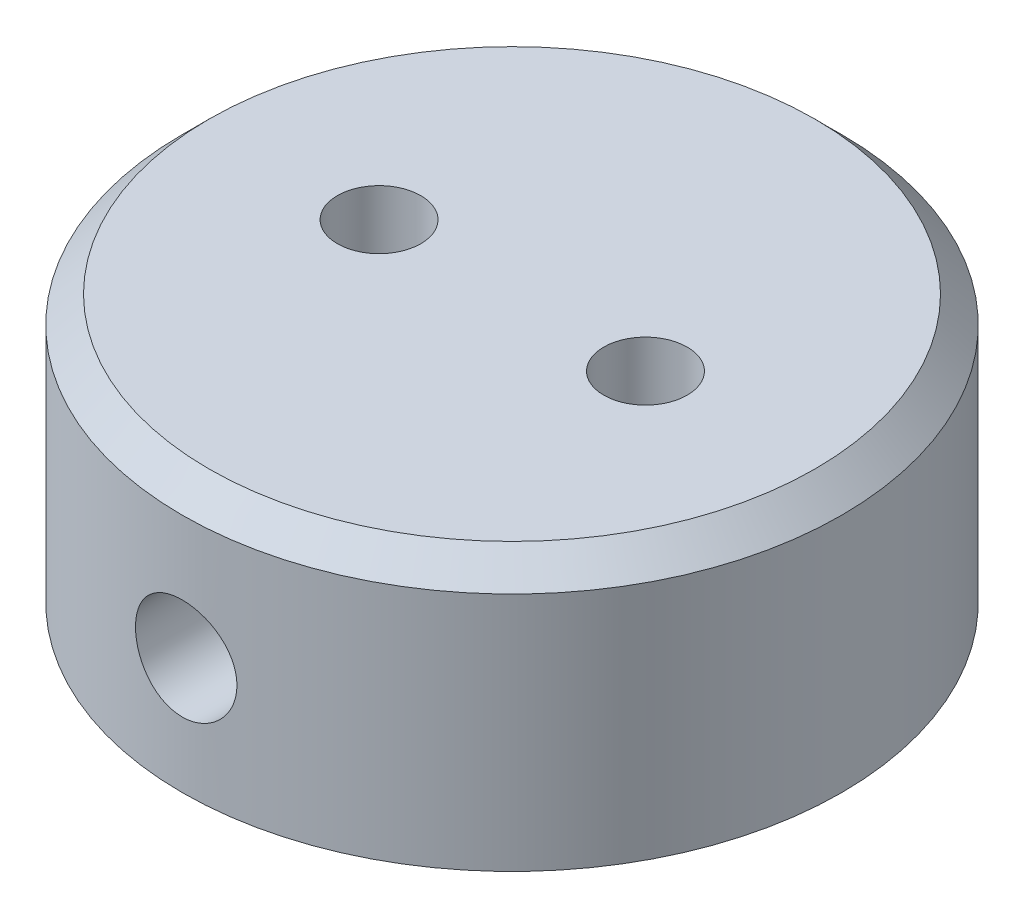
ISO-10303-21;
HEADER;
FILE_DESCRIPTION(('STEP AP214'),'2;1');
FILE_NAME('part.step','',(''),(''),'','','');
FILE_SCHEMA(('AUTOMOTIVE_DESIGN { 1 0 10303 214 1 1 1 1 }'));
ENDSEC;
DATA;
#1=APPLICATION_CONTEXT('core data for automotive mechanical design processes');
#2=APPLICATION_PROTOCOL_DEFINITION('international standard','automotive_design',2000,#1);
#3=PRODUCT_CONTEXT('',#1,'mechanical');
#4=PRODUCT('Part','Part','',(#3));
#5=PRODUCT_RELATED_PRODUCT_CATEGORY('part','',(#4));
#6=PRODUCT_DEFINITION_FORMATION('','',#4);
#7=PRODUCT_DEFINITION_CONTEXT('part definition',#1,'design');
#8=PRODUCT_DEFINITION('design','',#6,#7);
#9=PRODUCT_DEFINITION_SHAPE('','',#8);
#10=(LENGTH_UNIT() NAMED_UNIT(*) SI_UNIT(.MILLI.,.METRE.));
#11=(NAMED_UNIT(*) PLANE_ANGLE_UNIT() SI_UNIT($,.RADIAN.));
#12=(NAMED_UNIT(*) SI_UNIT($,.STERADIAN.) SOLID_ANGLE_UNIT());
#13=UNCERTAINTY_MEASURE_WITH_UNIT(LENGTH_MEASURE(1.E-05),#10,'distance_accuracy_value','');
#14=(GEOMETRIC_REPRESENTATION_CONTEXT(3) GLOBAL_UNCERTAINTY_ASSIGNED_CONTEXT((#13)) GLOBAL_UNIT_ASSIGNED_CONTEXT((#10,
#11,#12)) REPRESENTATION_CONTEXT('',''));
#15=CARTESIAN_POINT('',(0.,0.,0.));
#16=DIRECTION('',(0.,0.,1.));
#17=DIRECTION('',(1.,0.,0.));
#18=AXIS2_PLACEMENT_3D('',#15,#16,#17);
#19=CARTESIAN_POINT('',(0.,25.4,0.));
#20=DIRECTION('',(0.,-1.,0.));
#21=DIRECTION('',(0.,0.,-1.));
#22=AXIS2_PLACEMENT_3D('',#19,#20,#21);
#23=CYLINDRICAL_SURFACE('',#22,31.369);
#24=CARTESIAN_POINT('',(0.,15.8828739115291,-31.369));
#25=CARTESIAN_POINT('',(-0.134731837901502,15.882875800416,-31.3690007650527));
#26=CARTESIAN_POINT('',(-0.269437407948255,15.8772299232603,-31.3681303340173));
#27=CARTESIAN_POINT('',(-0.537926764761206,15.8546916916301,-31.3646745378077));
#28=CARTESIAN_POINT('',(-0.671710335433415,15.8377967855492,-31.362088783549));
#29=CARTESIAN_POINT('',(-0.937438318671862,15.7928698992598,-31.3552715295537));
#30=CARTESIAN_POINT('',(-1.06938145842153,15.7648305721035,-31.3510389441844));
#31=CARTESIAN_POINT('',(-1.33045329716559,15.6978154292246,-31.3410453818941));
#32=CARTESIAN_POINT('',(-1.4595809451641,15.6588356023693,-31.3352838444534));
#33=CARTESIAN_POINT('',(-1.71391464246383,15.5702854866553,-31.3224017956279));
#34=CARTESIAN_POINT('',(-1.83912502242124,15.5207274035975,-31.3152828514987));
#35=CARTESIAN_POINT('',(-2.08495432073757,15.4113368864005,-31.2998770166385));
#36=CARTESIAN_POINT('',(-2.20557152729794,15.3515006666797,-31.2915896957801));
#37=CARTESIAN_POINT('',(-2.4412744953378,15.2220300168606,-31.274083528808));
#38=CARTESIAN_POINT('',(-2.55636306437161,15.1524006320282,-31.2648651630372));
#39=CARTESIAN_POINT('',(-2.7803317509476,15.0037841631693,-31.2457445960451));
#40=CARTESIAN_POINT('',(-2.88920954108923,14.9247936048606,-31.2358421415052));
#41=CARTESIAN_POINT('',(-3.10070651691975,14.757442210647,-31.2155593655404));
#42=CARTESIAN_POINT('',(-3.20327679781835,14.6690199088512,-31.2051761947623));
#43=CARTESIAN_POINT('',(-3.40065684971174,14.4838446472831,-31.1842836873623));
#44=CARTESIAN_POINT('',(-3.49546373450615,14.3870886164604,-31.1737743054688));
#45=CARTESIAN_POINT('',(-3.6765922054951,14.1859716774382,-31.1529315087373));
#46=CARTESIAN_POINT('',(-3.76291640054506,14.0816131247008,-31.1425980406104));
#47=CARTESIAN_POINT('',(-3.92654057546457,13.8659460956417,-31.1223912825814));
#48=CARTESIAN_POINT('',(-4.00383721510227,13.7546350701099,-31.1125181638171));
#49=CARTESIAN_POINT('',(-4.14917716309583,13.525297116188,-31.0934702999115));
#50=CARTESIAN_POINT('',(-4.21717384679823,13.4072402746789,-31.08429916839));
#51=CARTESIAN_POINT('',(-4.34298872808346,13.1657362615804,-31.0669700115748));
#52=CARTESIAN_POINT('',(-4.40080312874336,13.0422871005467,-31.0588123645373));
#53=CARTESIAN_POINT('',(-4.55822647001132,12.6652369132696,-31.0362389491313));
#54=CARTESIAN_POINT('',(-4.64198387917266,12.4046671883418,-31.0236997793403));
#55=CARTESIAN_POINT('',(-4.76382724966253,11.8751424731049,-31.005223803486));
#56=CARTESIAN_POINT('',(-4.80226742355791,11.6062696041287,-30.9992358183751));
#57=CARTESIAN_POINT('',(-4.83357147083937,11.0657906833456,-30.9943707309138));
#58=CARTESIAN_POINT('',(-4.82643809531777,10.7941847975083,-30.9954931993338));
#59=CARTESIAN_POINT('',(-4.76706237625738,10.2584985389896,-31.0046793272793));
#60=CARTESIAN_POINT('',(-4.71521470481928,9.99437314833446,-31.0126822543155));
#61=CARTESIAN_POINT('',(-4.56850667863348,9.47861317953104,-31.0346316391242));
#62=CARTESIAN_POINT('',(-4.4736450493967,9.2269789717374,-31.048578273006));
#63=CARTESIAN_POINT('',(-4.24319205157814,8.74215110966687,-31.0809106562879));
#64=CARTESIAN_POINT('',(-4.10743425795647,8.50903781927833,-31.0993144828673));
#65=CARTESIAN_POINT('',(-3.79916149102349,8.06875049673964,-31.1384745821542));
#66=CARTESIAN_POINT('',(-3.6266439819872,7.86157825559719,-31.1592310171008));
#67=CARTESIAN_POINT('',(-3.24758618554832,7.47676762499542,-31.20102560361));
#68=CARTESIAN_POINT('',(-3.040706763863,7.29946320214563,-31.2220644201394));
#69=CARTESIAN_POINT('',(-2.59995160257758,6.98203863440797,-31.2618504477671));
#70=CARTESIAN_POINT('',(-2.36607573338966,6.84191866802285,-31.2805976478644));
#71=CARTESIAN_POINT('',(-1.87767162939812,6.60282042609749,-31.3137092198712));
#72=CARTESIAN_POINT('',(-1.62313017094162,6.50386874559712,-31.3280707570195));
#73=CARTESIAN_POINT('',(-1.10077218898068,6.35021062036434,-31.3507693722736));
#74=CARTESIAN_POINT('',(-0.832956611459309,6.29550102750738,-31.3591068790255));
#75=CARTESIAN_POINT('',(-0.294534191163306,6.23232608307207,-31.3687610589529));
#76=CARTESIAN_POINT('',(-0.0239824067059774,6.22340174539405,-31.3701474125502));
#77=CARTESIAN_POINT('',(0.514753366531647,6.25083115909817,-31.365933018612));
#78=CARTESIAN_POINT('',(0.782937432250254,6.28718343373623,-31.3603324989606));
#79=CARTESIAN_POINT('',(1.30792864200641,6.40375244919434,-31.3428167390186));
#80=CARTESIAN_POINT('',(1.56478678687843,6.48374477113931,-31.330933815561));
#81=CARTESIAN_POINT('',(2.06144589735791,6.68508603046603,-31.3021810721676));
#82=CARTESIAN_POINT('',(2.30124602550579,6.80643699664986,-31.2853110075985));
#83=CARTESIAN_POINT('',(2.75899490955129,7.08812170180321,-31.2482848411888));
#84=CARTESIAN_POINT('',(2.97676312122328,7.24874560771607,-31.2281046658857));
#85=CARTESIAN_POINT('',(3.38241644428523,7.60401473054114,-31.1867772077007));
#86=CARTESIAN_POINT('',(3.57029972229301,7.79866203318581,-31.1656298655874));
#87=CARTESIAN_POINT('',(3.91252724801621,8.21849575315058,-31.1245294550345));
#88=CARTESIAN_POINT('',(4.06656326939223,8.44393476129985,-31.1045884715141));
#89=CARTESIAN_POINT('',(4.33457779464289,8.9177679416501,-31.0683756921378));
#90=CARTESIAN_POINT('',(4.44855742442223,9.16616146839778,-31.0521037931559));
#91=CARTESIAN_POINT('',(4.63275434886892,9.67789505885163,-31.0251579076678));
#92=CARTESIAN_POINT('',(4.70313188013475,9.94117646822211,-31.01446344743));
#93=CARTESIAN_POINT('',(4.79861830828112,10.4761494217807,-30.9998364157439));
#94=CARTESIAN_POINT('',(4.82373050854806,10.7478403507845,-30.9959033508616));
#95=CARTESIAN_POINT('',(4.82690670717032,11.15392762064,-30.9954031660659));
#96=CARTESIAN_POINT('',(4.82232057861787,11.2884027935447,-30.9961200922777));
#97=CARTESIAN_POINT('',(4.80194890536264,11.5564680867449,-30.9992836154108));
#98=CARTESIAN_POINT('',(4.78616755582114,11.6900585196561,-31.0017295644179));
#99=CARTESIAN_POINT('',(4.74351242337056,11.9554541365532,-31.0082844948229));
#100=CARTESIAN_POINT('',(4.71663465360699,12.0872586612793,-31.0123940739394));
#101=CARTESIAN_POINT('',(4.65200356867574,12.3480666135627,-31.0221548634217));
#102=CARTESIAN_POINT('',(4.61425418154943,12.4770710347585,-31.0278055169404));
#103=CARTESIAN_POINT('',(4.5281769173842,12.7313589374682,-31.0404842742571));
#104=CARTESIAN_POINT('',(4.47985424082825,12.8566442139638,-31.0475117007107));
#105=CARTESIAN_POINT('',(4.37299149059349,13.102649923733,-31.0627432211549));
#106=CARTESIAN_POINT('',(4.31445509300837,13.223371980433,-31.0709468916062));
#107=CARTESIAN_POINT('',(4.18754698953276,13.4595184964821,-31.0883050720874));
#108=CARTESIAN_POINT('',(4.11917151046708,13.5749409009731,-31.097459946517));
#109=CARTESIAN_POINT('',(3.97310855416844,13.799615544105,-31.1164584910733));
#110=CARTESIAN_POINT('',(3.89542437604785,13.9088699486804,-31.1263019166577));
#111=CARTESIAN_POINT('',(3.73039864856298,14.1216277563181,-31.1465129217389));
#112=CARTESIAN_POINT('',(3.64296432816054,14.2250587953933,-31.1568849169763));
#113=CARTESIAN_POINT('',(3.45975628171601,14.424166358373,-31.1777603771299));
#114=CARTESIAN_POINT('',(3.36398556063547,14.5198456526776,-31.1882637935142));
#115=CARTESIAN_POINT('',(3.1646779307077,14.7028864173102,-31.2091175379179));
#116=CARTESIAN_POINT('',(3.06113640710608,14.79024287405,-31.2194677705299));
#117=CARTESIAN_POINT('',(2.84708991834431,14.9559335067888,-31.2397149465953));
#118=CARTESIAN_POINT('',(2.73658753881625,15.03427100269,-31.2496120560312));
#119=CARTESIAN_POINT('',(2.50864036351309,15.1818646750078,-31.2687390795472));
#120=CARTESIAN_POINT('',(2.39115679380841,15.2510615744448,-31.277964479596));
#121=CARTESIAN_POINT('',(2.15074387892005,15.3792725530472,-31.2954147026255));
#122=CARTESIAN_POINT('',(2.02781655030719,15.4382903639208,-31.3036398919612));
#123=CARTESIAN_POINT('',(1.77743135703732,15.5456994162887,-31.3188539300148));
#124=CARTESIAN_POINT('',(1.64997685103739,15.5940983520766,-31.3258436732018));
#125=CARTESIAN_POINT('',(1.391409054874,15.6799483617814,-31.3383934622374));
#126=CARTESIAN_POINT('',(1.26029658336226,15.7174018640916,-31.3439538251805));
#127=CARTESIAN_POINT('',(0.943421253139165,15.793556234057,-31.3553518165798));
#128=CARTESIAN_POINT('',(0.756345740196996,15.8270124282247,-31.3604468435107));
#129=CARTESIAN_POINT('',(0.379496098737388,15.8716697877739,-31.3672703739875));
#130=CARTESIAN_POINT('',(0.189722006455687,15.8828712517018,-31.3689989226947));
#131=CARTESIAN_POINT('',(0.,15.8828739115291,-31.369));
#132=B_SPLINE_CURVE_WITH_KNOTS('',3,(#24,#25,#26,#27,#28,#29,#30,#31,#32,#33,#34,#35,#36,#37,
#38,#39,#40,#41,#42,#43,#44,#45,#46,#47,#48,#49,#50,#51,#52,#53,#54,#55,#56,#57,#58,#59,#60,#61,
#62,#63,#64,#65,#66,#67,#68,#69,#70,#71,#72,#73,#74,#75,#76,#77,#78,#79,#80,#81,#82,#83,#84,#85,
#86,#87,#88,#89,#90,#91,#92,#93,#94,#95,#96,#97,#98,#99,#100,#101,#102,#103,#104,#105,#106,#107,
#108,#109,#110,#111,#112,#113,#114,#115,#116,#117,#118,#119,#120,#121,#122,#123,#124,#125,#126,
#127,#128,#129,#130,#131),.UNSPECIFIED.,.T.,.F.,(4,2,2,2,2,2,2,2,2,2,2,2,2,2,2,2,2,2,2,2,2,2,2,
2,2,2,2,2,2,2,2,2,2,2,2,2,2,2,2,2,2,2,2,2,2,2,2,2,2,2,2,2,2,4),(0.,0.404029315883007,
0.808150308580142,1.21253816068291,1.61707446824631,2.02114649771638,2.42536767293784,
2.82938135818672,3.23354546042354,3.64052621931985,4.04765760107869,4.45466337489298,
4.86181926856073,5.2709469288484,5.68022682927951,6.49785187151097,7.30904283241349,
8.1201848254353,8.92423968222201,9.72831836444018,10.5357144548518,11.3431662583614,
12.1591206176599,12.9750788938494,13.7915634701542,14.6079899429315,15.4162157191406,
16.2244151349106,17.0284970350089,17.8326183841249,18.6428706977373,19.4531726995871,
20.2705730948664,21.0879505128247,21.9023059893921,22.7166020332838,23.1198749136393,
23.5229967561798,23.9262635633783,24.3293848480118,24.7323083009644,25.135087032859,
25.5380206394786,25.9408118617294,26.3478290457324,26.7547001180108,27.1618147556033,
27.5687790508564,27.9782649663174,28.3876004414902,28.7966383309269,29.205585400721,
29.7745250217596,30.3434570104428),.UNSPECIFIED.);
#133=CARTESIAN_POINT('',(0.,15.8828739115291,-31.369));
#134=VERTEX_POINT('',#133);
#135=EDGE_CURVE('E10',#134,#134,#132,.T.);
#136=ORIENTED_EDGE('',*,*,#135,.T.);
#137=EDGE_LOOP('',(#136));
#138=FACE_BOUND('',#137,.T.);
#139=CARTESIAN_POINT('',(4.826,11.0568739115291,30.995546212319));
#140=CARTESIAN_POINT('',(4.82600189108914,10.9221526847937,30.9955454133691));
#141=CARTESIAN_POINT('',(4.82035689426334,10.7874577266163,30.9964262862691));
#142=CARTESIAN_POINT('',(4.79782226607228,10.5189898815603,30.999922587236));
#143=CARTESIAN_POINT('',(4.78093008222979,10.3852172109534,31.0025384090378));
#144=CARTESIAN_POINT('',(4.73601064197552,10.1195112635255,31.0094320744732));
#145=CARTESIAN_POINT('',(4.70797602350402,9.98757926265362,31.013711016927));
#146=CARTESIAN_POINT('',(4.64097249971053,9.72652993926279,31.0238083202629));
#147=CARTESIAN_POINT('',(4.60199958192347,9.59741366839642,31.0296272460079));
#148=CARTESIAN_POINT('',(4.51346615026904,9.34310417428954,31.0426284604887));
#149=CARTESIAN_POINT('',(4.46391798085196,9.21790657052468,31.0498091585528));
#150=CARTESIAN_POINT('',(4.35454969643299,8.97210173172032,31.0653361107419));
#151=CARTESIAN_POINT('',(4.29472579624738,8.85149620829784,31.0736827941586));
#152=CARTESIAN_POINT('',(4.16528167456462,8.61581452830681,31.0912986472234));
#153=CARTESIAN_POINT('',(4.09566648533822,8.50073557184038,31.1005673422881));
#154=CARTESIAN_POINT('',(3.94707971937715,8.27678348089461,31.1197740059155));
#155=CARTESIAN_POINT('',(3.86810466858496,8.16791267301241,31.129712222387));
#156=CARTESIAN_POINT('',(3.7007688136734,7.95640620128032,31.1500501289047));
#157=CARTESIAN_POINT('',(3.61234483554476,7.85382078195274,31.160452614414));
#158=CARTESIAN_POINT('',(3.42716301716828,7.65641031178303,31.1813629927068));
#159=CARTESIAN_POINT('',(3.33040210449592,7.56158814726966,31.1918709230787));
#160=CARTESIAN_POINT('',(3.12927236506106,7.38042977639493,31.2126902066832));
#161=CARTESIAN_POINT('',(3.02490591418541,7.29409093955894,31.2230016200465));
#162=CARTESIAN_POINT('',(2.80922008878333,7.13043860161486,31.2431461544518));
#163=CARTESIAN_POINT('',(2.69789816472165,7.05312844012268,31.2529790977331));
#164=CARTESIAN_POINT('',(2.46855150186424,6.90777312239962,31.2719314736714));
#165=CARTESIAN_POINT('',(2.35049767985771,6.83977328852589,31.2810473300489));
#166=CARTESIAN_POINT('',(2.10899943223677,6.71395178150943,31.2982585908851));
#167=CARTESIAN_POINT('',(1.98555301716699,6.65613390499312,31.3063536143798));
#168=CARTESIAN_POINT('',(1.60851114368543,6.49869985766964,31.3287390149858));
#169=CARTESIAN_POINT('',(1.34794746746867,6.41493518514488,31.3411524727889));
#170=CARTESIAN_POINT('',(0.818443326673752,6.2930772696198,31.3594328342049));
#171=CARTESIAN_POINT('',(0.549585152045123,6.25462897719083,31.365350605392));
#172=CARTESIAN_POINT('',(0.0091351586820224,6.22330359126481,31.3701614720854));
#173=CARTESIAN_POINT('',(-0.262456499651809,6.23042383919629,31.3690549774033));
#174=CARTESIAN_POINT('',(-0.798199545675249,6.28977836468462,31.3599786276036));
#175=CARTESIAN_POINT('',(-1.06239439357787,6.34163120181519,31.3520668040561));
#176=CARTESIAN_POINT('',(-1.57829059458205,6.48837347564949,31.3303344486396));
#177=CARTESIAN_POINT('',(-1.82999161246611,6.58326406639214,31.3165137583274));
#178=CARTESIAN_POINT('',(-2.31490204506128,6.81377785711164,31.2844167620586));
#179=CARTESIAN_POINT('',(-2.54803428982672,6.94956086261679,31.2661230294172));
#180=CARTESIAN_POINT('',(-2.98834891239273,7.25788788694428,31.227117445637));
#181=CARTESIAN_POINT('',(-3.19552949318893,7.4304344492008,31.2064054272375));
#182=CARTESIAN_POINT('',(-3.58030884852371,7.80951337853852,31.1646188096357));
#183=CARTESIAN_POINT('',(-3.75757947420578,8.01637882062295,31.1435426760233));
#184=CARTESIAN_POINT('',(-4.07494243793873,8.45709378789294,31.1036118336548));
#185=CARTESIAN_POINT('',(-4.21503452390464,8.69094349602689,31.0847571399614));
#186=CARTESIAN_POINT('',(-4.45411248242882,9.17933944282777,31.0514041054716));
#187=CARTESIAN_POINT('',(-4.5530633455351,9.43390308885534,31.0369094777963));
#188=CARTESIAN_POINT('',(-4.70671308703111,9.95630945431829,31.0139824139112));
#189=CARTESIAN_POINT('',(-4.76141525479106,10.2241511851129,31.0055495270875));
#190=CARTESIAN_POINT('',(-4.82456210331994,10.7625874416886,30.9957866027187));
#191=CARTESIAN_POINT('',(-4.83347253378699,11.0331260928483,30.9943850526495));
#192=CARTESIAN_POINT('',(-4.80601999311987,11.5718323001,30.9986534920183));
#193=CARTESIAN_POINT('',(-4.76965850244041,11.8399999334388,31.0043232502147));
#194=CARTESIAN_POINT('',(-4.65308979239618,12.3649008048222,31.0220296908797));
#195=CARTESIAN_POINT('',(-4.57311572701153,12.6216870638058,31.03403250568));
#196=CARTESIAN_POINT('',(-4.37183494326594,13.1182104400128,31.0630246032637));
#197=CARTESIAN_POINT('',(-4.2505260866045,13.3579466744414,31.0800141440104));
#198=CARTESIAN_POINT('',(-3.96890486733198,13.8156492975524,31.1172333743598));
#199=CARTESIAN_POINT('',(-3.8082916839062,14.0334285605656,31.1374876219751));
#200=CARTESIAN_POINT('',(-3.45303706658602,14.4391091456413,31.1788806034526));
#201=CARTESIAN_POINT('',(-3.25839360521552,14.6270086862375,31.2000193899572));
#202=CARTESIAN_POINT('',(-2.83855338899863,14.9692752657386,31.2410238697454));
#203=CARTESIAN_POINT('',(-2.61310323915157,15.1233332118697,31.2608767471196));
#204=CARTESIAN_POINT('',(-2.13924155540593,15.3913861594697,31.2968714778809));
#205=CARTESIAN_POINT('',(-1.89083067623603,15.5053823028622,31.3130134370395));
#206=CARTESIAN_POINT('',(-1.37910488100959,15.6895893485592,31.3397132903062));
#207=CARTESIAN_POINT('',(-1.11585121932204,15.7599676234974,31.3502925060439));
#208=CARTESIAN_POINT('',(-0.58093717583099,15.8554649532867,31.3647579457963));
#209=CARTESIAN_POINT('',(-0.309277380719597,15.8805871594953,31.368644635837));
#210=CARTESIAN_POINT('',(0.0968021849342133,15.883786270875,31.3691421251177));
#211=CARTESIAN_POINT('',(0.231299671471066,15.8792061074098,31.3684347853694));
#212=CARTESIAN_POINT('',(0.499410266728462,15.8588425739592,31.3653097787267));
#213=CARTESIAN_POINT('',(0.633023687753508,15.8430633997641,31.3628927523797));
#214=CARTESIAN_POINT('',(0.898465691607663,15.8004086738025,31.356411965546));
#215=CARTESIAN_POINT('',(1.03029361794,15.7735291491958,31.352347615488));
#216=CARTESIAN_POINT('',(1.29114852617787,15.7088904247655,31.3426884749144));
#217=CARTESIAN_POINT('',(1.42017650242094,15.6711351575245,31.3370942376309));
#218=CARTESIAN_POINT('',(1.67451490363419,15.585040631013,31.3245330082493));
#219=CARTESIAN_POINT('',(1.79982701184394,15.5367062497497,31.3175666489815));
#220=CARTESIAN_POINT('',(2.04588461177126,15.4298154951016,31.3024552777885));
#221=CARTESIAN_POINT('',(2.16663172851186,15.3712628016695,31.2943106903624));
#222=CARTESIAN_POINT('',(2.40282540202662,15.2443180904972,31.2770622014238));
#223=CARTESIAN_POINT('',(2.51826990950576,15.1759223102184,31.2679579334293));
#224=CARTESIAN_POINT('',(2.74298494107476,15.0298154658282,31.24904648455));
#225=CARTESIAN_POINT('',(2.85225763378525,14.9521077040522,31.2392395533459));
#226=CARTESIAN_POINT('',(3.06501649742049,14.7870563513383,31.2190866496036));
#227=CARTESIAN_POINT('',(3.16843229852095,14.6996225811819,31.2087362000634));
#228=CARTESIAN_POINT('',(3.36750912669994,14.5164187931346,31.1878832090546));
#229=CARTESIAN_POINT('',(3.46317292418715,14.420651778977,31.1773807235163));
#230=CARTESIAN_POINT('',(3.64618313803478,14.2213546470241,31.1565081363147));
#231=CARTESIAN_POINT('',(3.73352452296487,14.1178198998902,31.1461381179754));
#232=CARTESIAN_POINT('',(3.89918598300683,13.9037900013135,31.1258328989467));
#233=CARTESIAN_POINT('',(3.97750937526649,13.7932974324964,31.1158975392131));
#234=CARTESIAN_POINT('',(4.12508576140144,13.5653580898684,31.0966783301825));
#235=CARTESIAN_POINT('',(4.19427827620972,13.4478717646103,31.0873989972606));
#236=CARTESIAN_POINT('',(4.32248023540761,13.2074538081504,31.069832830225));
#237=CARTESIAN_POINT('',(4.38149341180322,13.0845241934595,31.0615456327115));
#238=CARTESIAN_POINT('',(4.48889309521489,12.8341345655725,31.0462065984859));
#239=CARTESIAN_POINT('',(4.53728731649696,12.7066779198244,31.039153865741));
#240=CARTESIAN_POINT('',(4.62312792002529,12.4481053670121,31.026484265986));
#241=CARTESIAN_POINT('',(4.66057673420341,12.3169902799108,31.0208670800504));
#242=CARTESIAN_POINT('',(4.73671145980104,12.0001422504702,31.0093497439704));
#243=CARTESIAN_POINT('',(4.77015667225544,11.8130973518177,31.0041975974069));
#244=CARTESIAN_POINT('',(4.8147994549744,11.4363088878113,30.9972964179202));
#245=CARTESIAN_POINT('',(4.82599733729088,11.2465653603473,30.9955473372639));
#246=CARTESIAN_POINT('',(4.826,11.0568739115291,30.995546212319));
#247=B_SPLINE_CURVE_WITH_KNOTS('',3,(#139,#140,#141,#142,#143,#144,#145,#146,#147,#148,#149,
#150,#151,#152,#153,#154,#155,#156,#157,#158,#159,#160,#161,#162,#163,#164,#165,#166,#167,#168,
#169,#170,#171,#172,#173,#174,#175,#176,#177,#178,#179,#180,#181,#182,#183,#184,#185,#186,#187,
#188,#189,#190,#191,#192,#193,#194,#195,#196,#197,#198,#199,#200,#201,#202,#203,#204,#205,#206,
#207,#208,#209,#210,#211,#212,#213,#214,#215,#216,#217,#218,#219,#220,#221,#222,#223,#224,#225,
#226,#227,#228,#229,#230,#231,#232,#233,#234,#235,#236,#237,#238,#239,#240,#241,#242,#243,#244,
#245,#246),.UNSPECIFIED.,.T.,.F.,(4,2,2,2,2,2,2,2,2,2,2,2,2,2,2,2,2,2,2,2,2,2,2,2,2,2,2,2,2,2,2,
2,2,2,2,2,2,2,2,2,2,2,2,2,2,2,2,2,2,2,2,2,2,4),(0.,0.403997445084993,0.808086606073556,
1.21244320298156,1.61694832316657,2.02098382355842,2.42516847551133,2.82914614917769,
3.23327423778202,3.64029689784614,4.04747020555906,4.45451685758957,4.86171359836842,
5.27082697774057,5.68009258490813,6.49769047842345,7.30883906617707,8.11994033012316,
8.9241928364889,9.72846690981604,10.5359257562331,11.3434404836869,12.1593078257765,
12.9751806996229,13.7917464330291,14.6082514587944,15.4164351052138,16.2245923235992,
17.0284708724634,17.8323910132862,18.6426678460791,19.4529929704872,20.2704369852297,
21.0878576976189,21.902122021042,22.7163296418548,23.1196686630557,23.5228566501,
23.9261890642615,24.3293758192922,24.7323770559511,25.1352334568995,25.538244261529,
25.9411125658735,26.3480890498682,26.7549194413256,27.1619942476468,27.5689188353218,
27.9784162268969,28.3877631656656,28.7968117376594,29.2057693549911,29.7746176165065,
30.3434578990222),.UNSPECIFIED.);
#248=CARTESIAN_POINT('',(4.826,11.0568739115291,30.995546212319));
#249=VERTEX_POINT('',#248);
#250=EDGE_CURVE('E42',#249,#249,#247,.T.);
#251=ORIENTED_EDGE('',*,*,#250,.T.);
#252=EDGE_LOOP('',(#251));
#253=FACE_BOUND('',#252,.T.);
#254=CARTESIAN_POINT('',(0.,22.86,0.));
#255=DIRECTION('',(0.,1.,0.));
#256=DIRECTION('',(0.,0.,1.));
#257=AXIS2_PLACEMENT_3D('',#254,#255,#256);
#258=CIRCLE('',#257,31.369);
#259=CARTESIAN_POINT('',(0.,22.86,31.369));
#260=VERTEX_POINT('',#259);
#261=EDGE_CURVE('E46',#260,#260,#258,.F.);
#262=ORIENTED_EDGE('',*,*,#261,.T.);
#263=EDGE_LOOP('',(#262));
#264=FACE_BOUND('',#263,.T.);
#265=CARTESIAN_POINT('',(0.,0.,0.));
#266=DIRECTION('',(0.,1.,0.));
#267=DIRECTION('',(0.,0.,1.));
#268=AXIS2_PLACEMENT_3D('',#265,#266,#267);
#269=CIRCLE('',#268,31.369);
#270=CARTESIAN_POINT('',(0.,0.,31.369));
#271=VERTEX_POINT('',#270);
#272=EDGE_CURVE('E88',#271,#271,#269,.T.);
#273=ORIENTED_EDGE('',*,*,#272,.T.);
#274=EDGE_LOOP('',(#273));
#275=FACE_BOUND('',#274,.T.);
#276=ADVANCED_FACE('F32',(#138,#253,#264,#275),#23,.T.);
#277=CARTESIAN_POINT('',(0.,25.4,0.));
#278=DIRECTION('',(0.,1.,0.));
#279=DIRECTION('',(0.,0.,1.));
#280=AXIS2_PLACEMENT_3D('',#277,#278,#279);
#281=PLANE('',#280);
#282=CARTESIAN_POINT('',(-12.4527623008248,25.4,0.194451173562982));
#283=DIRECTION('',(0.,1.,0.));
#284=DIRECTION('',(0.,0.,1.));
#285=AXIS2_PLACEMENT_3D('',#282,#283,#284);
#286=CIRCLE('',#285,3.96874999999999);
#287=CARTESIAN_POINT('',(-12.4527623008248,25.4,4.16320117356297));
#288=VERTEX_POINT('',#287);
#289=EDGE_CURVE('E80',#288,#288,#286,.T.);
#290=ORIENTED_EDGE('',*,*,#289,.F.);
#291=EDGE_LOOP('',(#290));
#292=FACE_BOUND('',#291,.T.);
#293=CARTESIAN_POINT('',(12.7,25.4,0.));
#294=DIRECTION('',(0.,1.,0.));
#295=DIRECTION('',(0.,0.,1.));
#296=AXIS2_PLACEMENT_3D('',#293,#294,#295);
#297=CIRCLE('',#296,3.96874999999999);
#298=CARTESIAN_POINT('',(12.7,25.4,3.96874999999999));
#299=VERTEX_POINT('',#298);
#300=EDGE_CURVE('E84',#299,#299,#297,.T.);
#301=ORIENTED_EDGE('',*,*,#300,.F.);
#302=EDGE_LOOP('',(#301));
#303=FACE_BOUND('',#302,.T.);
#304=CARTESIAN_POINT('',(0.,25.4,0.));
#305=DIRECTION('',(0.,1.,0.));
#306=DIRECTION('',(0.,0.,1.));
#307=AXIS2_PLACEMENT_3D('',#304,#305,#306);
#308=CIRCLE('',#307,28.829);
#309=CARTESIAN_POINT('',(0.,25.4,28.829));
#310=VERTEX_POINT('',#309);
#311=EDGE_CURVE('E50',#310,#310,#308,.T.);
#312=ORIENTED_EDGE('',*,*,#311,.T.);
#313=EDGE_LOOP('',(#312));
#314=FACE_BOUND('',#313,.T.);
#315=ADVANCED_FACE('F70',(#292,#303,#314),#281,.T.);
#316=CARTESIAN_POINT('',(0.,0.,0.));
#317=DIRECTION('',(0.,1.,0.));
#318=DIRECTION('',(0.,0.,1.));
#319=AXIS2_PLACEMENT_3D('',#316,#317,#318);
#320=PLANE('',#319);
#321=CARTESIAN_POINT('',(-12.4527623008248,0.,0.194451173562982));
#322=DIRECTION('',(0.,-1.,0.));
#323=DIRECTION('',(0.,0.,-1.));
#324=AXIS2_PLACEMENT_3D('',#321,#322,#323);
#325=CIRCLE('',#324,3.96874999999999);
#326=CARTESIAN_POINT('',(-12.4527623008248,0.,-3.77429882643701));
#327=VERTEX_POINT('',#326);
#328=EDGE_CURVE('E97',#327,#327,#325,.T.);
#329=ORIENTED_EDGE('',*,*,#328,.F.);
#330=EDGE_LOOP('',(#329));
#331=FACE_BOUND('',#330,.T.);
#332=CARTESIAN_POINT('',(12.7,0.,0.));
#333=DIRECTION('',(0.,-1.,0.));
#334=DIRECTION('',(0.,0.,-1.));
#335=AXIS2_PLACEMENT_3D('',#332,#333,#334);
#336=CIRCLE('',#335,3.96874999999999);
#337=CARTESIAN_POINT('',(12.7,0.,-3.96874999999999));
#338=VERTEX_POINT('',#337);
#339=EDGE_CURVE('E93',#338,#338,#336,.T.);
#340=ORIENTED_EDGE('',*,*,#339,.F.);
#341=EDGE_LOOP('',(#340));
#342=FACE_BOUND('',#341,.T.);
#343=ORIENTED_EDGE('',*,*,#272,.F.);
#344=EDGE_LOOP('',(#343));
#345=FACE_BOUND('',#344,.T.);
#346=ADVANCED_FACE('F67',(#331,#342,#345),#320,.F.);
#347=CARTESIAN_POINT('',(0.,25.4,0.));
#348=DIRECTION('',(0.,-1.,0.));
#349=DIRECTION('',(0.,0.,-1.));
#350=AXIS2_PLACEMENT_3D('',#347,#348,#349);
#351=CONICAL_SURFACE('',#350,28.829,0.785398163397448);
#352=ORIENTED_EDGE('',*,*,#261,.F.);
#353=EDGE_LOOP('',(#352));
#354=FACE_BOUND('',#353,.T.);
#355=ORIENTED_EDGE('',*,*,#311,.F.);
#356=EDGE_LOOP('',(#355));
#357=FACE_BOUND('',#356,.T.);
#358=ADVANCED_FACE('F61',(#354,#357),#351,.T.);
#359=CARTESIAN_POINT('',(0.,11.0568739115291,-31.369));
#360=DIRECTION('',(0.,0.,1.));
#361=DIRECTION('',(1.,0.,0.));
#362=AXIS2_PLACEMENT_3D('',#359,#360,#361);
#363=CYLINDRICAL_SURFACE('',#362,4.826);
#364=ORIENTED_EDGE('',*,*,#250,.F.);
#365=EDGE_LOOP('',(#364));
#366=FACE_BOUND('',#365,.T.);
#367=ORIENTED_EDGE('',*,*,#135,.F.);
#368=EDGE_LOOP('',(#367));
#369=FACE_BOUND('',#368,.T.);
#370=ADVANCED_FACE('F55',(#366,#369),#363,.F.);
#371=CARTESIAN_POINT('',(12.7,0.,0.));
#372=DIRECTION('',(0.,-1.,0.));
#373=DIRECTION('',(0.,0.,-1.));
#374=AXIS2_PLACEMENT_3D('',#371,#372,#373);
#375=CYLINDRICAL_SURFACE('',#374,3.96874999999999);
#376=ORIENTED_EDGE('',*,*,#300,.T.);
#377=EDGE_LOOP('',(#376));
#378=FACE_BOUND('',#377,.T.);
#379=ORIENTED_EDGE('',*,*,#339,.T.);
#380=EDGE_LOOP('',(#379));
#381=FACE_BOUND('',#380,.T.);
#382=ADVANCED_FACE('F60',(#378,#381),#375,.F.);
#383=CARTESIAN_POINT('',(-12.4527623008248,0.,0.194451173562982));
#384=DIRECTION('',(0.,-1.,0.));
#385=DIRECTION('',(0.,0.,-1.));
#386=AXIS2_PLACEMENT_3D('',#383,#384,#385);
#387=CYLINDRICAL_SURFACE('',#386,3.96874999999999);
#388=ORIENTED_EDGE('',*,*,#289,.T.);
#389=EDGE_LOOP('',(#388));
#390=FACE_BOUND('',#389,.T.);
#391=ORIENTED_EDGE('',*,*,#328,.T.);
#392=EDGE_LOOP('',(#391));
#393=FACE_BOUND('',#392,.T.);
#394=ADVANCED_FACE('F101',(#390,#393),#387,.F.);
#395=CLOSED_SHELL('',(#276,#315,#346,#358,#370,#382,#394));
#396=MANIFOLD_SOLID_BREP('B2',#395);
#397=ADVANCED_BREP_SHAPE_REPRESENTATION('',(#18,#396),#14);
#398=SHAPE_DEFINITION_REPRESENTATION(#9,#397);
ENDSEC;
END-ISO-10303-21;
